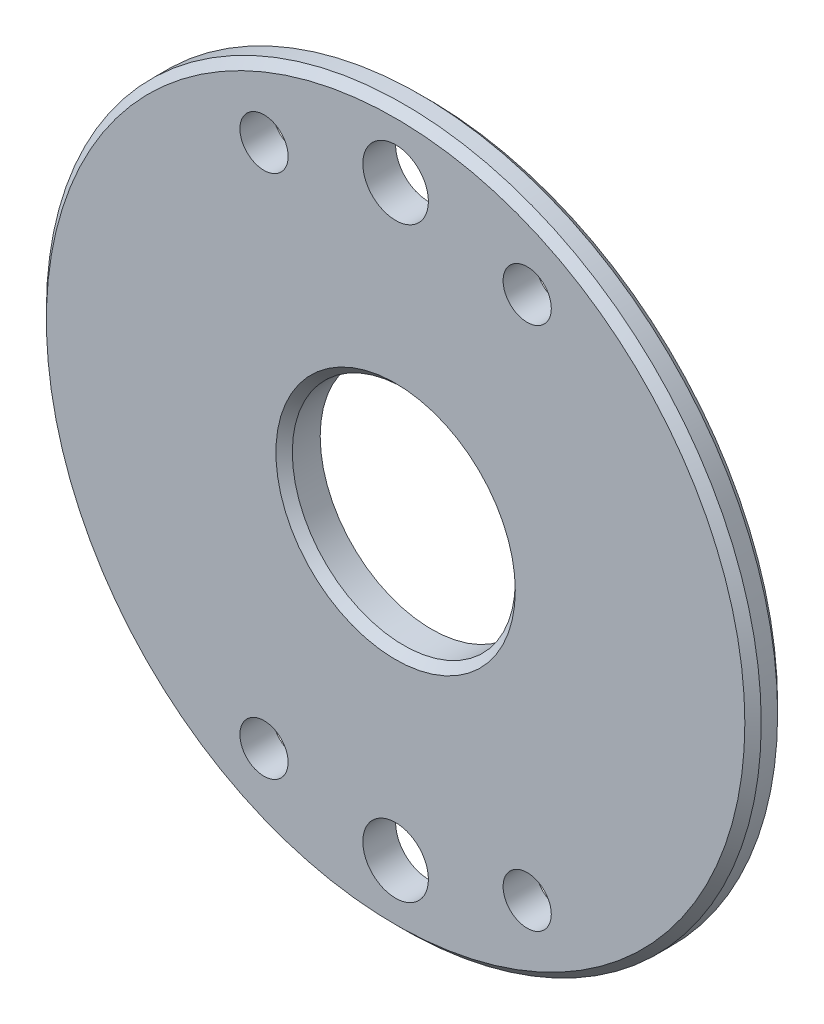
from build123d import *

# Parameters (mm, degrees)
SKETCH1_R           = 109
SKETCH1_R_2         = 10
SKETCH1_R_3         = 34
SKETCH1_R_4         = 7.35
BOSS_EXTRUDE1_DEPTH = 10
CHAMFER1_SIZE       = 2.5
CHAMFER2_SIZE       = 2.5
BOSS_EXTRUDE2_START = 1
SKETCH2_R           = 75
SKETCH2_R_2         = 34
BOSS_EXTRUDE2_DEPTH = 1


with BuildPart() as part:
    # Sketch1 → Boss-Extrude1 (new body)
    with BuildSketch(Plane.XY):
        Circle(SKETCH1_R)
        with Locations((0, 89.5)):
            Circle(SKETCH1_R_2, mode=Mode.SUBTRACT)
        with Locations((0, -89.5)):
            Circle(SKETCH1_R_2, mode=Mode.SUBTRACT)
        Circle(SKETCH1_R_3, mode=Mode.SUBTRACT)
        with Locations((-40.127920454, 80)):
            Circle(SKETCH1_R_4, mode=Mode.SUBTRACT)
        with Locations((40.127920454, 80)):
            Circle(SKETCH1_R_4, mode=Mode.SUBTRACT)
        with Locations((40.127920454, -80)):
            Circle(SKETCH1_R_4, mode=Mode.SUBTRACT)
        with Locations((-40.127920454, -80)):
            Circle(SKETCH1_R_4, mode=Mode.SUBTRACT)
    extrude(amount=BOSS_EXTRUDE1_DEPTH)

    # Chamfer1
    chamfer1_edges = [part.edges().sort_by_distance(p)[0] for p in [
        (-34, 0, 10),
    ]]
    chamfer(chamfer1_edges, length=CHAMFER1_SIZE)

    # Chamfer2
    chamfer2_edges = [part.edges().sort_by_distance(p)[0] for p in [
        (-109, 0, 0),
        (-109, 0, 10),
    ]]
    chamfer(chamfer2_edges, length=CHAMFER2_SIZE)

    # Sketch2 → Boss-Extrude2 (add)
    with BuildSketch(Plane(origin=(0, 0, 0), x_dir=(-1, 0, 0), z_dir=(0, 0, -1)).offset(BOSS_EXTRUDE2_START)):
        Circle(SKETCH2_R)
        Circle(SKETCH2_R_2, mode=Mode.SUBTRACT)
    extrude(amount=-BOSS_EXTRUDE2_DEPTH)


solid = part.part
